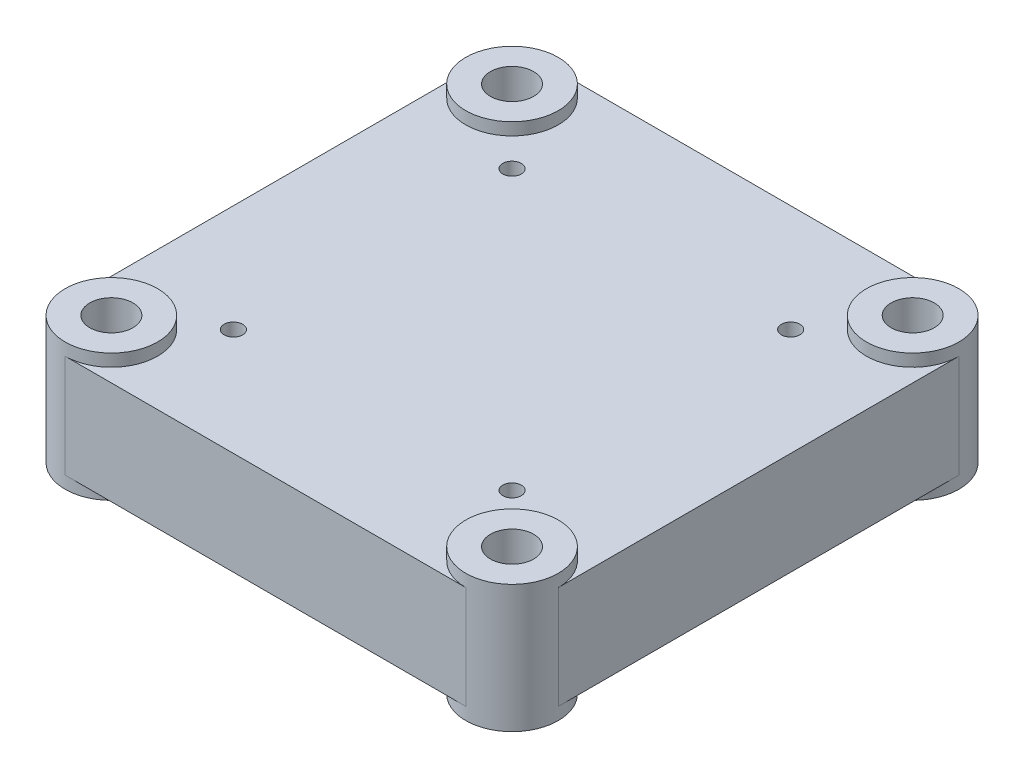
ISO-10303-21;
HEADER;
FILE_DESCRIPTION(('STEP AP214'),'2;1');
FILE_NAME('part.step','',(''),(''),'','','');
FILE_SCHEMA(('AUTOMOTIVE_DESIGN { 1 0 10303 214 1 1 1 1 }'));
ENDSEC;
DATA;
#1=APPLICATION_CONTEXT('core data for automotive mechanical design processes');
#2=APPLICATION_PROTOCOL_DEFINITION('international standard','automotive_design',2000,#1);
#3=PRODUCT_CONTEXT('',#1,'mechanical');
#4=PRODUCT('Part','Part','',(#3));
#5=PRODUCT_RELATED_PRODUCT_CATEGORY('part','',(#4));
#6=PRODUCT_DEFINITION_FORMATION('','',#4);
#7=PRODUCT_DEFINITION_CONTEXT('part definition',#1,'design');
#8=PRODUCT_DEFINITION('design','',#6,#7);
#9=PRODUCT_DEFINITION_SHAPE('','',#8);
#10=(LENGTH_UNIT() NAMED_UNIT(*) SI_UNIT(.MILLI.,.METRE.));
#11=(NAMED_UNIT(*) PLANE_ANGLE_UNIT() SI_UNIT($,.RADIAN.));
#12=(NAMED_UNIT(*) SI_UNIT($,.STERADIAN.) SOLID_ANGLE_UNIT());
#13=UNCERTAINTY_MEASURE_WITH_UNIT(LENGTH_MEASURE(1.E-05),#10,'distance_accuracy_value','');
#14=(GEOMETRIC_REPRESENTATION_CONTEXT(3) GLOBAL_UNCERTAINTY_ASSIGNED_CONTEXT((#13)) GLOBAL_UNIT_ASSIGNED_CONTEXT((#10,
#11,#12)) REPRESENTATION_CONTEXT('',''));
#15=CARTESIAN_POINT('',(0.,0.,0.));
#16=DIRECTION('',(0.,0.,1.));
#17=DIRECTION('',(1.,0.,0.));
#18=AXIS2_PLACEMENT_3D('',#15,#16,#17);
#19=CARTESIAN_POINT('',(-32.5,0.,32.5));
#20=DIRECTION('',(0.,-1.,0.));
#21=DIRECTION('',(0.,0.,-1.));
#22=AXIS2_PLACEMENT_3D('',#19,#20,#21);
#23=PLANE('',#22);
#24=CARTESIAN_POINT('',(0.,0.,0.));
#25=DIRECTION('',(0.,-1.,0.));
#26=DIRECTION('',(0.,0.,-1.));
#27=AXIS2_PLACEMENT_3D('',#24,#25,#26);
#28=CIRCLE('',#27,17.4);
#29=CARTESIAN_POINT('',(0.,0.,-17.4));
#30=VERTEX_POINT('',#29);
#31=EDGE_CURVE('E226',#30,#30,#28,.T.);
#32=ORIENTED_EDGE('',*,*,#31,.F.);
#33=EDGE_LOOP('',(#32));
#34=FACE_BOUND('',#33,.T.);
#35=CARTESIAN_POINT('',(-22.6005050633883,0.,-22.6005050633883));
#36=DIRECTION('',(0.,1.,0.));
#37=DIRECTION('',(0.,0.,1.));
#38=AXIS2_PLACEMENT_3D('',#35,#36,#37);
#39=CIRCLE('',#38,1.5);
#40=CARTESIAN_POINT('',(-22.6005050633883,0.,-21.1005050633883));
#41=VERTEX_POINT('',#40);
#42=EDGE_CURVE('E186',#41,#41,#39,.T.);
#43=ORIENTED_EDGE('',*,*,#42,.T.);
#44=EDGE_LOOP('',(#43));
#45=FACE_BOUND('',#44,.T.);
#46=CARTESIAN_POINT('',(22.6005050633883,0.,22.6005050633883));
#47=DIRECTION('',(0.,1.,0.));
#48=DIRECTION('',(0.,0.,1.));
#49=AXIS2_PLACEMENT_3D('',#46,#47,#48);
#50=CIRCLE('',#49,1.5);
#51=CARTESIAN_POINT('',(22.6005050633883,0.,24.1005050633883));
#52=VERTEX_POINT('',#51);
#53=EDGE_CURVE('E166',#52,#52,#50,.T.);
#54=ORIENTED_EDGE('',*,*,#53,.T.);
#55=EDGE_LOOP('',(#54));
#56=FACE_BOUND('',#55,.T.);
#57=CARTESIAN_POINT('',(-22.6005050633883,0.,22.6005050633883));
#58=DIRECTION('',(0.,1.,0.));
#59=DIRECTION('',(0.,0.,-1.));
#60=AXIS2_PLACEMENT_3D('',#57,#58,#59);
#61=CIRCLE('',#60,1.5);
#62=CARTESIAN_POINT('',(-22.6005050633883,0.,21.1005050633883));
#63=VERTEX_POINT('',#62);
#64=EDGE_CURVE('E180',#63,#63,#61,.T.);
#65=ORIENTED_EDGE('',*,*,#64,.T.);
#66=EDGE_LOOP('',(#65));
#67=FACE_BOUND('',#66,.T.);
#68=CARTESIAN_POINT('',(22.6005050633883,0.,-22.6005050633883));
#69=DIRECTION('',(0.,1.,0.));
#70=DIRECTION('',(0.,0.,-1.));
#71=AXIS2_PLACEMENT_3D('',#68,#69,#70);
#72=CIRCLE('',#71,1.5);
#73=CARTESIAN_POINT('',(22.6005050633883,0.,-24.1005050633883));
#74=VERTEX_POINT('',#73);
#75=EDGE_CURVE('E192',#74,#74,#72,.T.);
#76=ORIENTED_EDGE('',*,*,#75,.T.);
#77=EDGE_LOOP('',(#76));
#78=FACE_BOUND('',#77,.T.);
#79=DIRECTION('',(0.,0.,1.));
#80=VECTOR('',#79,1.);
#81=CARTESIAN_POINT('',(-40.,0.,32.5));
#82=LINE('',#81,#80);
#83=CARTESIAN_POINT('',(-40.,0.,-32.4999999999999));
#84=VERTEX_POINT('',#83);
#85=CARTESIAN_POINT('',(-40.,0.,32.5));
#86=VERTEX_POINT('',#85);
#87=EDGE_CURVE('E113',#84,#86,#82,.T.);
#88=ORIENTED_EDGE('',*,*,#87,.F.);
#89=CARTESIAN_POINT('',(-32.5,0.,-32.5));
#90=DIRECTION('',(0.,-1.,0.));
#91=DIRECTION('',(0.,0.,-1.));
#92=AXIS2_PLACEMENT_3D('',#89,#90,#91);
#93=CIRCLE('',#92,7.5);
#94=CARTESIAN_POINT('',(-32.5,0.,-40.));
#95=VERTEX_POINT('',#94);
#96=EDGE_CURVE('E79',#95,#84,#93,.T.);
#97=ORIENTED_EDGE('',*,*,#96,.F.);
#98=DIRECTION('',(-1.,0.,0.));
#99=VECTOR('',#98,1.);
#100=CARTESIAN_POINT('',(-32.5,0.,-40.));
#101=LINE('',#100,#99);
#102=CARTESIAN_POINT('',(32.4999999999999,0.,-40.));
#103=VERTEX_POINT('',#102);
#104=EDGE_CURVE('E111',#103,#95,#101,.T.);
#105=ORIENTED_EDGE('',*,*,#104,.F.);
#106=CARTESIAN_POINT('',(32.5,0.,-32.5));
#107=DIRECTION('',(0.,-1.,0.));
#108=DIRECTION('',(0.,0.,-1.));
#109=AXIS2_PLACEMENT_3D('',#106,#107,#108);
#110=CIRCLE('',#109,7.5);
#111=CARTESIAN_POINT('',(40.,0.,-32.4999999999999));
#112=VERTEX_POINT('',#111);
#113=EDGE_CURVE('E71',#112,#103,#110,.T.);
#114=ORIENTED_EDGE('',*,*,#113,.F.);
#115=DIRECTION('',(0.,0.,-1.));
#116=VECTOR('',#115,1.);
#117=CARTESIAN_POINT('',(40.,0.,32.5));
#118=LINE('',#117,#116);
#119=CARTESIAN_POINT('',(40.,0.,32.5));
#120=VERTEX_POINT('',#119);
#121=EDGE_CURVE('E124',#120,#112,#118,.T.);
#122=ORIENTED_EDGE('',*,*,#121,.F.);
#123=CARTESIAN_POINT('',(32.5,0.,32.5));
#124=DIRECTION('',(0.,-1.,0.));
#125=DIRECTION('',(0.,0.,-1.));
#126=AXIS2_PLACEMENT_3D('',#123,#124,#125);
#127=CIRCLE('',#126,7.5);
#128=CARTESIAN_POINT('',(32.4999999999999,0.,40.));
#129=VERTEX_POINT('',#128);
#130=EDGE_CURVE('E160',#129,#120,#127,.T.);
#131=ORIENTED_EDGE('',*,*,#130,.F.);
#132=DIRECTION('',(1.,0.,0.));
#133=VECTOR('',#132,1.);
#134=CARTESIAN_POINT('',(-32.5,0.,40.));
#135=LINE('',#134,#133);
#136=CARTESIAN_POINT('',(-32.5,0.,40.));
#137=VERTEX_POINT('',#136);
#138=EDGE_CURVE('E149',#137,#129,#135,.T.);
#139=ORIENTED_EDGE('',*,*,#138,.F.);
#140=CARTESIAN_POINT('',(-32.5,0.,32.5));
#141=DIRECTION('',(0.,-1.,0.));
#142=DIRECTION('',(0.,0.,-1.));
#143=AXIS2_PLACEMENT_3D('',#140,#141,#142);
#144=CIRCLE('',#143,7.5);
#145=EDGE_CURVE('E155',#86,#137,#144,.T.);
#146=ORIENTED_EDGE('',*,*,#145,.F.);
#147=EDGE_LOOP('',(#88,#97,#105,#114,#122,#131,#139,#146));
#148=FACE_BOUND('',#147,.T.);
#149=ADVANCED_FACE('F34',(#34,#45,#56,#67,#78,#148),#23,.T.);
#150=CARTESIAN_POINT('',(-32.5,16.7,32.5));
#151=DIRECTION('',(0.,-1.,0.));
#152=DIRECTION('',(0.,0.,-1.));
#153=AXIS2_PLACEMENT_3D('',#150,#151,#152);
#154=PLANE('',#153);
#155=DIRECTION('',(-1.,0.,0.));
#156=VECTOR('',#155,1.);
#157=CARTESIAN_POINT('',(-32.5,16.7,-40.));
#158=LINE('',#157,#156);
#159=CARTESIAN_POINT('',(32.4999999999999,16.7,-40.));
#160=VERTEX_POINT('',#159);
#161=CARTESIAN_POINT('',(-32.5,16.7,-40.));
#162=VERTEX_POINT('',#161);
#163=EDGE_CURVE('E171',#160,#162,#158,.T.);
#164=ORIENTED_EDGE('',*,*,#163,.T.);
#165=CARTESIAN_POINT('',(-32.5,16.7,-32.5));
#166=DIRECTION('',(0.,-1.,0.));
#167=DIRECTION('',(0.,0.,-1.));
#168=AXIS2_PLACEMENT_3D('',#165,#166,#167);
#169=CIRCLE('',#168,7.5);
#170=CARTESIAN_POINT('',(-40.,16.7,-32.5));
#171=VERTEX_POINT('',#170);
#172=EDGE_CURVE('E128',#162,#171,#169,.T.);
#173=ORIENTED_EDGE('',*,*,#172,.T.);
#174=DIRECTION('',(0.,0.,1.));
#175=VECTOR('',#174,1.);
#176=CARTESIAN_POINT('',(-40.,16.7,32.5));
#177=LINE('',#176,#175);
#178=CARTESIAN_POINT('',(-40.,16.7,32.5));
#179=VERTEX_POINT('',#178);
#180=EDGE_CURVE('E52',#171,#179,#177,.T.);
#181=ORIENTED_EDGE('',*,*,#180,.T.);
#182=CARTESIAN_POINT('',(-32.5,16.7,32.5));
#183=DIRECTION('',(0.,-1.,0.));
#184=DIRECTION('',(0.,0.,-1.));
#185=AXIS2_PLACEMENT_3D('',#182,#183,#184);
#186=CIRCLE('',#185,7.5);
#187=CARTESIAN_POINT('',(-32.5,16.7,40.));
#188=VERTEX_POINT('',#187);
#189=EDGE_CURVE('E154',#179,#188,#186,.T.);
#190=ORIENTED_EDGE('',*,*,#189,.T.);
#191=DIRECTION('',(1.,0.,0.));
#192=VECTOR('',#191,1.);
#193=CARTESIAN_POINT('',(-32.5,16.7,40.));
#194=LINE('',#193,#192);
#195=CARTESIAN_POINT('',(32.4999999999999,16.7,40.));
#196=VERTEX_POINT('',#195);
#197=EDGE_CURVE('E85',#188,#196,#194,.T.);
#198=ORIENTED_EDGE('',*,*,#197,.T.);
#199=CARTESIAN_POINT('',(32.5,16.7,32.5));
#200=DIRECTION('',(0.,-1.,0.));
#201=DIRECTION('',(0.,0.,-1.));
#202=AXIS2_PLACEMENT_3D('',#199,#200,#201);
#203=CIRCLE('',#202,7.5);
#204=CARTESIAN_POINT('',(40.,16.7,32.5));
#205=VERTEX_POINT('',#204);
#206=EDGE_CURVE('E204',#196,#205,#203,.T.);
#207=ORIENTED_EDGE('',*,*,#206,.T.);
#208=DIRECTION('',(0.,0.,-1.));
#209=VECTOR('',#208,1.);
#210=CARTESIAN_POINT('',(40.,16.7,32.5));
#211=LINE('',#210,#209);
#212=CARTESIAN_POINT('',(40.,16.7,-32.5));
#213=VERTEX_POINT('',#212);
#214=EDGE_CURVE('E172',#205,#213,#211,.T.);
#215=ORIENTED_EDGE('',*,*,#214,.T.);
#216=CARTESIAN_POINT('',(32.5,16.7,-32.5));
#217=DIRECTION('',(0.,-1.,0.));
#218=DIRECTION('',(0.,0.,-1.));
#219=AXIS2_PLACEMENT_3D('',#216,#217,#218);
#220=CIRCLE('',#219,7.5);
#221=EDGE_CURVE('E11',#213,#160,#220,.T.);
#222=ORIENTED_EDGE('',*,*,#221,.T.);
#223=EDGE_LOOP('',(#164,#173,#181,#190,#198,#207,#215,#222));
#224=FACE_BOUND('',#223,.T.);
#225=CARTESIAN_POINT('',(22.6005050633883,16.7,22.6005050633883));
#226=DIRECTION('',(0.,1.,0.));
#227=DIRECTION('',(0.,0.,1.));
#228=AXIS2_PLACEMENT_3D('',#225,#226,#227);
#229=CIRCLE('',#228,1.5);
#230=CARTESIAN_POINT('',(22.6005050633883,16.7,24.1005050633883));
#231=VERTEX_POINT('',#230);
#232=EDGE_CURVE('E161',#231,#231,#229,.T.);
#233=ORIENTED_EDGE('',*,*,#232,.F.);
#234=EDGE_LOOP('',(#233));
#235=FACE_BOUND('',#234,.T.);
#236=CARTESIAN_POINT('',(-22.6005050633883,16.7,22.6005050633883));
#237=DIRECTION('',(0.,1.,0.));
#238=DIRECTION('',(0.,0.,-1.));
#239=AXIS2_PLACEMENT_3D('',#236,#237,#238);
#240=CIRCLE('',#239,1.5);
#241=CARTESIAN_POINT('',(-22.6005050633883,16.7,21.1005050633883));
#242=VERTEX_POINT('',#241);
#243=EDGE_CURVE('E178',#242,#242,#240,.T.);
#244=ORIENTED_EDGE('',*,*,#243,.F.);
#245=EDGE_LOOP('',(#244));
#246=FACE_BOUND('',#245,.T.);
#247=CARTESIAN_POINT('',(-22.6005050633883,16.7,-22.6005050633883));
#248=DIRECTION('',(0.,1.,0.));
#249=DIRECTION('',(0.,0.,1.));
#250=AXIS2_PLACEMENT_3D('',#247,#248,#249);
#251=CIRCLE('',#250,1.5);
#252=CARTESIAN_POINT('',(-22.6005050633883,16.7,-21.1005050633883));
#253=VERTEX_POINT('',#252);
#254=EDGE_CURVE('E183',#253,#253,#251,.T.);
#255=ORIENTED_EDGE('',*,*,#254,.F.);
#256=EDGE_LOOP('',(#255));
#257=FACE_BOUND('',#256,.T.);
#258=CARTESIAN_POINT('',(22.6005050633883,16.7,-22.6005050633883));
#259=DIRECTION('',(0.,1.,0.));
#260=DIRECTION('',(0.,0.,-1.));
#261=AXIS2_PLACEMENT_3D('',#258,#259,#260);
#262=CIRCLE('',#261,1.5);
#263=CARTESIAN_POINT('',(22.6005050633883,16.7,-24.1005050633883));
#264=VERTEX_POINT('',#263);
#265=EDGE_CURVE('E189',#264,#264,#262,.T.);
#266=ORIENTED_EDGE('',*,*,#265,.F.);
#267=EDGE_LOOP('',(#266));
#268=FACE_BOUND('',#267,.T.);
#269=ADVANCED_FACE('F268',(#224,#235,#246,#257,#268),#154,.F.);
#270=CARTESIAN_POINT('',(-32.5,16.7,32.5));
#271=DIRECTION('',(0.,-1.,0.));
#272=DIRECTION('',(0.,0.,-1.));
#273=AXIS2_PLACEMENT_3D('',#270,#271,#272);
#274=CYLINDRICAL_SURFACE('',#273,7.5);
#275=DIRECTION('',(0.,-1.,0.));
#276=VECTOR('',#275,1.);
#277=CARTESIAN_POINT('',(-40.,16.7,32.5));
#278=LINE('',#277,#276);
#279=EDGE_CURVE('E133',#179,#86,#278,.T.);
#280=ORIENTED_EDGE('',*,*,#279,.T.);
#281=ORIENTED_EDGE('',*,*,#145,.T.);
#282=DIRECTION('',(0.,-1.,0.));
#283=VECTOR('',#282,1.);
#284=CARTESIAN_POINT('',(-32.5,16.7,40.));
#285=LINE('',#284,#283);
#286=EDGE_CURVE('E38',#188,#137,#285,.T.);
#287=ORIENTED_EDGE('',*,*,#286,.F.);
#288=ORIENTED_EDGE('',*,*,#189,.F.);
#289=EDGE_LOOP('',(#280,#281,#287,#288));
#290=FACE_BOUND('',#289,.T.);
#291=CARTESIAN_POINT('',(-32.5,18.7,32.5));
#292=DIRECTION('',(0.,-1.,0.));
#293=DIRECTION('',(0.,0.,-1.));
#294=AXIS2_PLACEMENT_3D('',#291,#292,#293);
#295=CIRCLE('',#294,7.5);
#296=CARTESIAN_POINT('',(-32.5,18.7,25.));
#297=VERTEX_POINT('',#296);
#298=EDGE_CURVE('E211',#297,#297,#295,.T.);
#299=ORIENTED_EDGE('',*,*,#298,.T.);
#300=EDGE_LOOP('',(#299));
#301=FACE_BOUND('',#300,.T.);
#302=CARTESIAN_POINT('',(-32.5,-2.,32.5));
#303=DIRECTION('',(0.,-1.,0.));
#304=DIRECTION('',(0.,0.,-1.));
#305=AXIS2_PLACEMENT_3D('',#302,#303,#304);
#306=CIRCLE('',#305,7.5);
#307=CARTESIAN_POINT('',(-32.5,-2.,25.));
#308=VERTEX_POINT('',#307);
#309=EDGE_CURVE('E156',#308,#308,#306,.T.);
#310=ORIENTED_EDGE('',*,*,#309,.F.);
#311=EDGE_LOOP('',(#310));
#312=FACE_BOUND('',#311,.T.);
#313=ADVANCED_FACE('F36',(#290,#301,#312),#274,.T.);
#314=CARTESIAN_POINT('',(-32.5,16.7,40.));
#315=DIRECTION('',(0.,0.,-1.));
#316=DIRECTION('',(-1.,0.,0.));
#317=AXIS2_PLACEMENT_3D('',#314,#315,#316);
#318=PLANE('',#317);
#319=ORIENTED_EDGE('',*,*,#138,.T.);
#320=DIRECTION('',(0.,-1.,0.));
#321=VECTOR('',#320,1.);
#322=CARTESIAN_POINT('',(32.4999999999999,16.7,40.));
#323=LINE('',#322,#321);
#324=EDGE_CURVE('E140',#196,#129,#323,.T.);
#325=ORIENTED_EDGE('',*,*,#324,.F.);
#326=ORIENTED_EDGE('',*,*,#197,.F.);
#327=ORIENTED_EDGE('',*,*,#286,.T.);
#328=EDGE_LOOP('',(#319,#325,#326,#327));
#329=FACE_BOUND('',#328,.T.);
#330=ADVANCED_FACE('F147',(#329),#318,.F.);
#331=CARTESIAN_POINT('',(32.5,16.7,32.5));
#332=DIRECTION('',(0.,-1.,0.));
#333=DIRECTION('',(0.,0.,-1.));
#334=AXIS2_PLACEMENT_3D('',#331,#332,#333);
#335=CYLINDRICAL_SURFACE('',#334,7.5);
#336=ORIENTED_EDGE('',*,*,#324,.T.);
#337=ORIENTED_EDGE('',*,*,#130,.T.);
#338=DIRECTION('',(0.,-1.,0.));
#339=VECTOR('',#338,1.);
#340=CARTESIAN_POINT('',(40.,16.7,32.5));
#341=LINE('',#340,#339);
#342=EDGE_CURVE('E138',#205,#120,#341,.T.);
#343=ORIENTED_EDGE('',*,*,#342,.F.);
#344=ORIENTED_EDGE('',*,*,#206,.F.);
#345=EDGE_LOOP('',(#336,#337,#343,#344));
#346=FACE_BOUND('',#345,.T.);
#347=CARTESIAN_POINT('',(32.5,18.7,32.5));
#348=DIRECTION('',(0.,-1.,0.));
#349=DIRECTION('',(0.,0.,-1.));
#350=AXIS2_PLACEMENT_3D('',#347,#348,#349);
#351=CIRCLE('',#350,7.5);
#352=CARTESIAN_POINT('',(32.5,18.7,25.));
#353=VERTEX_POINT('',#352);
#354=EDGE_CURVE('E203',#353,#353,#351,.T.);
#355=ORIENTED_EDGE('',*,*,#354,.T.);
#356=EDGE_LOOP('',(#355));
#357=FACE_BOUND('',#356,.T.);
#358=CARTESIAN_POINT('',(32.5,-2.,32.5));
#359=DIRECTION('',(0.,-1.,0.));
#360=DIRECTION('',(0.,0.,-1.));
#361=AXIS2_PLACEMENT_3D('',#358,#359,#360);
#362=CIRCLE('',#361,7.5);
#363=CARTESIAN_POINT('',(32.5,-2.,25.));
#364=VERTEX_POINT('',#363);
#365=EDGE_CURVE('E238',#364,#364,#362,.T.);
#366=ORIENTED_EDGE('',*,*,#365,.F.);
#367=EDGE_LOOP('',(#366));
#368=FACE_BOUND('',#367,.T.);
#369=ADVANCED_FACE('F294',(#346,#357,#368),#335,.T.);
#370=CARTESIAN_POINT('',(40.,16.7,32.5));
#371=DIRECTION('',(-1.,0.,0.));
#372=DIRECTION('',(0.,0.,1.));
#373=AXIS2_PLACEMENT_3D('',#370,#371,#372);
#374=PLANE('',#373);
#375=ORIENTED_EDGE('',*,*,#121,.T.);
#376=DIRECTION('',(0.,-1.,0.));
#377=VECTOR('',#376,1.);
#378=CARTESIAN_POINT('',(40.,16.7,-32.4999999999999));
#379=LINE('',#378,#377);
#380=EDGE_CURVE('E131',#213,#112,#379,.T.);
#381=ORIENTED_EDGE('',*,*,#380,.F.);
#382=ORIENTED_EDGE('',*,*,#214,.F.);
#383=ORIENTED_EDGE('',*,*,#342,.T.);
#384=EDGE_LOOP('',(#375,#381,#382,#383));
#385=FACE_BOUND('',#384,.T.);
#386=ADVANCED_FACE('F291',(#385),#374,.F.);
#387=CARTESIAN_POINT('',(32.5,16.7,-32.5));
#388=DIRECTION('',(0.,-1.,0.));
#389=DIRECTION('',(0.,0.,-1.));
#390=AXIS2_PLACEMENT_3D('',#387,#388,#389);
#391=CYLINDRICAL_SURFACE('',#390,7.5);
#392=ORIENTED_EDGE('',*,*,#380,.T.);
#393=ORIENTED_EDGE('',*,*,#113,.T.);
#394=DIRECTION('',(0.,-1.,0.));
#395=VECTOR('',#394,1.);
#396=CARTESIAN_POINT('',(32.4999999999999,16.7,-40.));
#397=LINE('',#396,#395);
#398=EDGE_CURVE('E123',#160,#103,#397,.T.);
#399=ORIENTED_EDGE('',*,*,#398,.F.);
#400=ORIENTED_EDGE('',*,*,#221,.F.);
#401=EDGE_LOOP('',(#392,#393,#399,#400));
#402=FACE_BOUND('',#401,.T.);
#403=CARTESIAN_POINT('',(32.5,18.7,-32.5));
#404=DIRECTION('',(0.,-1.,0.));
#405=DIRECTION('',(0.,0.,-1.));
#406=AXIS2_PLACEMENT_3D('',#403,#404,#405);
#407=CIRCLE('',#406,7.5);
#408=CARTESIAN_POINT('',(32.5,18.7,-40.));
#409=VERTEX_POINT('',#408);
#410=EDGE_CURVE('E195',#409,#409,#407,.T.);
#411=ORIENTED_EDGE('',*,*,#410,.T.);
#412=EDGE_LOOP('',(#411));
#413=FACE_BOUND('',#412,.T.);
#414=CARTESIAN_POINT('',(32.5,-2.,-32.5));
#415=DIRECTION('',(0.,-1.,0.));
#416=DIRECTION('',(0.,0.,-1.));
#417=AXIS2_PLACEMENT_3D('',#414,#415,#416);
#418=CIRCLE('',#417,7.5);
#419=CARTESIAN_POINT('',(32.5,-2.,-40.));
#420=VERTEX_POINT('',#419);
#421=EDGE_CURVE('E229',#420,#420,#418,.T.);
#422=ORIENTED_EDGE('',*,*,#421,.F.);
#423=EDGE_LOOP('',(#422));
#424=FACE_BOUND('',#423,.T.);
#425=ADVANCED_FACE('F288',(#402,#413,#424),#391,.T.);
#426=CARTESIAN_POINT('',(-32.5,16.7,-40.));
#427=DIRECTION('',(0.,0.,1.));
#428=DIRECTION('',(1.,0.,0.));
#429=AXIS2_PLACEMENT_3D('',#426,#427,#428);
#430=PLANE('',#429);
#431=ORIENTED_EDGE('',*,*,#104,.T.);
#432=DIRECTION('',(0.,-1.,0.));
#433=VECTOR('',#432,1.);
#434=CARTESIAN_POINT('',(-32.5,16.7,-40.));
#435=LINE('',#434,#433);
#436=EDGE_CURVE('E121',#162,#95,#435,.T.);
#437=ORIENTED_EDGE('',*,*,#436,.F.);
#438=ORIENTED_EDGE('',*,*,#163,.F.);
#439=ORIENTED_EDGE('',*,*,#398,.T.);
#440=EDGE_LOOP('',(#431,#437,#438,#439));
#441=FACE_BOUND('',#440,.T.);
#442=ADVANCED_FACE('F119',(#441),#430,.F.);
#443=CARTESIAN_POINT('',(-32.5,16.7,-32.5));
#444=DIRECTION('',(0.,-1.,0.));
#445=DIRECTION('',(0.,0.,-1.));
#446=AXIS2_PLACEMENT_3D('',#443,#444,#445);
#447=CYLINDRICAL_SURFACE('',#446,7.5);
#448=ORIENTED_EDGE('',*,*,#436,.T.);
#449=ORIENTED_EDGE('',*,*,#96,.T.);
#450=DIRECTION('',(0.,-1.,0.));
#451=VECTOR('',#450,1.);
#452=CARTESIAN_POINT('',(-40.,16.7,-32.4999999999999));
#453=LINE('',#452,#451);
#454=EDGE_CURVE('E129',#171,#84,#453,.T.);
#455=ORIENTED_EDGE('',*,*,#454,.F.);
#456=ORIENTED_EDGE('',*,*,#172,.F.);
#457=EDGE_LOOP('',(#448,#449,#455,#456));
#458=FACE_BOUND('',#457,.T.);
#459=CARTESIAN_POINT('',(-32.5,18.7,-32.5));
#460=DIRECTION('',(0.,-1.,0.));
#461=DIRECTION('',(0.,0.,-1.));
#462=AXIS2_PLACEMENT_3D('',#459,#460,#461);
#463=CIRCLE('',#462,7.5);
#464=CARTESIAN_POINT('',(-32.5,18.7,-40.));
#465=VERTEX_POINT('',#464);
#466=EDGE_CURVE('E218',#465,#465,#463,.T.);
#467=ORIENTED_EDGE('',*,*,#466,.T.);
#468=EDGE_LOOP('',(#467));
#469=FACE_BOUND('',#468,.T.);
#470=CARTESIAN_POINT('',(-32.5,-2.,-32.5));
#471=DIRECTION('',(0.,-1.,0.));
#472=DIRECTION('',(0.,0.,-1.));
#473=AXIS2_PLACEMENT_3D('',#470,#471,#472);
#474=CIRCLE('',#473,7.5);
#475=CARTESIAN_POINT('',(-32.5,-2.,-40.));
#476=VERTEX_POINT('',#475);
#477=EDGE_CURVE('E114',#476,#476,#474,.T.);
#478=ORIENTED_EDGE('',*,*,#477,.F.);
#479=EDGE_LOOP('',(#478));
#480=FACE_BOUND('',#479,.T.);
#481=ADVANCED_FACE('F126',(#458,#469,#480),#447,.T.);
#482=CARTESIAN_POINT('',(-40.,16.7,32.5));
#483=DIRECTION('',(1.,0.,0.));
#484=DIRECTION('',(0.,0.,-1.));
#485=AXIS2_PLACEMENT_3D('',#482,#483,#484);
#486=PLANE('',#485);
#487=ORIENTED_EDGE('',*,*,#87,.T.);
#488=ORIENTED_EDGE('',*,*,#279,.F.);
#489=ORIENTED_EDGE('',*,*,#180,.F.);
#490=ORIENTED_EDGE('',*,*,#454,.T.);
#491=EDGE_LOOP('',(#487,#488,#489,#490));
#492=FACE_BOUND('',#491,.T.);
#493=ADVANCED_FACE('F279',(#492),#486,.F.);
#494=CARTESIAN_POINT('',(32.5,16.7,-32.5));
#495=DIRECTION('',(0.,-1.,0.));
#496=DIRECTION('',(0.,0.,-1.));
#497=AXIS2_PLACEMENT_3D('',#494,#495,#496);
#498=CYLINDRICAL_SURFACE('',#497,3.5);
#499=CARTESIAN_POINT('',(32.5,18.7,-32.5));
#500=DIRECTION('',(0.,-1.,0.));
#501=DIRECTION('',(0.,0.,-1.));
#502=AXIS2_PLACEMENT_3D('',#499,#500,#501);
#503=CIRCLE('',#502,3.50000000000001);
#504=CARTESIAN_POINT('',(32.5,18.7,-36.));
#505=VERTEX_POINT('',#504);
#506=EDGE_CURVE('E200',#505,#505,#503,.T.);
#507=ORIENTED_EDGE('',*,*,#506,.F.);
#508=EDGE_LOOP('',(#507));
#509=FACE_BOUND('',#508,.T.);
#510=CARTESIAN_POINT('',(32.5,-2.,-32.5));
#511=DIRECTION('',(0.,-1.,0.));
#512=DIRECTION('',(0.,0.,-1.));
#513=AXIS2_PLACEMENT_3D('',#510,#511,#512);
#514=CIRCLE('',#513,3.50000000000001);
#515=CARTESIAN_POINT('',(32.5,-2.,-36.));
#516=VERTEX_POINT('',#515);
#517=EDGE_CURVE('E233',#516,#516,#514,.T.);
#518=ORIENTED_EDGE('',*,*,#517,.T.);
#519=EDGE_LOOP('',(#518));
#520=FACE_BOUND('',#519,.T.);
#521=ADVANCED_FACE('F282',(#509,#520),#498,.F.);
#522=CARTESIAN_POINT('',(-32.5,16.7,32.5));
#523=DIRECTION('',(0.,-1.,0.));
#524=DIRECTION('',(0.,0.,-1.));
#525=AXIS2_PLACEMENT_3D('',#522,#523,#524);
#526=CYLINDRICAL_SURFACE('',#525,3.49999999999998);
#527=CARTESIAN_POINT('',(-32.5,18.7,32.5));
#528=DIRECTION('',(0.,-1.,0.));
#529=DIRECTION('',(0.,0.,-1.));
#530=AXIS2_PLACEMENT_3D('',#527,#528,#529);
#531=CIRCLE('',#530,3.50000000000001);
#532=CARTESIAN_POINT('',(-32.5,18.7,29.));
#533=VERTEX_POINT('',#532);
#534=EDGE_CURVE('E213',#533,#533,#531,.T.);
#535=ORIENTED_EDGE('',*,*,#534,.F.);
#536=EDGE_LOOP('',(#535));
#537=FACE_BOUND('',#536,.T.);
#538=CARTESIAN_POINT('',(-32.5,-2.,32.5));
#539=DIRECTION('',(0.,-1.,0.));
#540=DIRECTION('',(0.,0.,-1.));
#541=AXIS2_PLACEMENT_3D('',#538,#539,#540);
#542=CIRCLE('',#541,3.50000000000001);
#543=CARTESIAN_POINT('',(-32.5,-2.,29.));
#544=VERTEX_POINT('',#543);
#545=EDGE_CURVE('E157',#544,#544,#542,.T.);
#546=ORIENTED_EDGE('',*,*,#545,.T.);
#547=EDGE_LOOP('',(#546));
#548=FACE_BOUND('',#547,.T.);
#549=ADVANCED_FACE('F427',(#537,#548),#526,.F.);
#550=CARTESIAN_POINT('',(-32.5,16.7,-32.5));
#551=DIRECTION('',(0.,-1.,0.));
#552=DIRECTION('',(0.,0.,-1.));
#553=AXIS2_PLACEMENT_3D('',#550,#551,#552);
#554=CYLINDRICAL_SURFACE('',#553,3.5);
#555=CARTESIAN_POINT('',(-32.5,18.7,-32.5));
#556=DIRECTION('',(0.,-1.,0.));
#557=DIRECTION('',(0.,0.,-1.));
#558=AXIS2_PLACEMENT_3D('',#555,#556,#557);
#559=CIRCLE('',#558,3.50000000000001);
#560=CARTESIAN_POINT('',(-32.5,18.7,-36.));
#561=VERTEX_POINT('',#560);
#562=EDGE_CURVE('E220',#561,#561,#559,.T.);
#563=ORIENTED_EDGE('',*,*,#562,.F.);
#564=EDGE_LOOP('',(#563));
#565=FACE_BOUND('',#564,.T.);
#566=CARTESIAN_POINT('',(-32.5,-2.,-32.5));
#567=DIRECTION('',(0.,-1.,0.));
#568=DIRECTION('',(0.,0.,-1.));
#569=AXIS2_PLACEMENT_3D('',#566,#567,#568);
#570=CIRCLE('',#569,3.50000000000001);
#571=CARTESIAN_POINT('',(-32.5,-2.,-36.));
#572=VERTEX_POINT('',#571);
#573=EDGE_CURVE('E115',#572,#572,#570,.T.);
#574=ORIENTED_EDGE('',*,*,#573,.T.);
#575=EDGE_LOOP('',(#574));
#576=FACE_BOUND('',#575,.T.);
#577=ADVANCED_FACE('F254',(#565,#576),#554,.F.);
#578=CARTESIAN_POINT('',(32.5,16.7,32.5));
#579=DIRECTION('',(0.,-1.,0.));
#580=DIRECTION('',(0.,0.,-1.));
#581=AXIS2_PLACEMENT_3D('',#578,#579,#580);
#582=CYLINDRICAL_SURFACE('',#581,3.50000000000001);
#583=CARTESIAN_POINT('',(32.5,18.7,32.5));
#584=DIRECTION('',(0.,-1.,0.));
#585=DIRECTION('',(0.,0.,-1.));
#586=AXIS2_PLACEMENT_3D('',#583,#584,#585);
#587=CIRCLE('',#586,3.50000000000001);
#588=CARTESIAN_POINT('',(32.5,18.7,29.));
#589=VERTEX_POINT('',#588);
#590=EDGE_CURVE('E206',#589,#589,#587,.T.);
#591=ORIENTED_EDGE('',*,*,#590,.F.);
#592=EDGE_LOOP('',(#591));
#593=FACE_BOUND('',#592,.T.);
#594=CARTESIAN_POINT('',(32.5,-2.,32.5));
#595=DIRECTION('',(0.,-1.,0.));
#596=DIRECTION('',(0.,0.,-1.));
#597=AXIS2_PLACEMENT_3D('',#594,#595,#596);
#598=CIRCLE('',#597,3.50000000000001);
#599=CARTESIAN_POINT('',(32.5,-2.,29.));
#600=VERTEX_POINT('',#599);
#601=EDGE_CURVE('E240',#600,#600,#598,.T.);
#602=ORIENTED_EDGE('',*,*,#601,.T.);
#603=EDGE_LOOP('',(#602));
#604=FACE_BOUND('',#603,.T.);
#605=ADVANCED_FACE('F451',(#593,#604),#582,.F.);
#606=CARTESIAN_POINT('',(22.6005050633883,16.7,22.6005050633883));
#607=DIRECTION('',(0.,-1.,0.));
#608=DIRECTION('',(0.,0.,-1.));
#609=AXIS2_PLACEMENT_3D('',#606,#607,#608);
#610=CYLINDRICAL_SURFACE('',#609,1.5);
#611=ORIENTED_EDGE('',*,*,#232,.T.);
#612=EDGE_LOOP('',(#611));
#613=FACE_BOUND('',#612,.T.);
#614=ORIENTED_EDGE('',*,*,#53,.F.);
#615=EDGE_LOOP('',(#614));
#616=FACE_BOUND('',#615,.T.);
#617=ADVANCED_FACE('F463',(#613,#616),#610,.F.);
#618=CARTESIAN_POINT('',(-22.6005050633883,16.7,22.6005050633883));
#619=DIRECTION('',(0.,-1.,0.));
#620=DIRECTION('',(0.,0.,-1.));
#621=AXIS2_PLACEMENT_3D('',#618,#619,#620);
#622=CYLINDRICAL_SURFACE('',#621,1.5);
#623=ORIENTED_EDGE('',*,*,#243,.T.);
#624=EDGE_LOOP('',(#623));
#625=FACE_BOUND('',#624,.T.);
#626=ORIENTED_EDGE('',*,*,#64,.F.);
#627=EDGE_LOOP('',(#626));
#628=FACE_BOUND('',#627,.T.);
#629=ADVANCED_FACE('F503',(#625,#628),#622,.F.);
#630=CARTESIAN_POINT('',(-22.6005050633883,16.7,-22.6005050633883));
#631=DIRECTION('',(0.,-1.,0.));
#632=DIRECTION('',(0.,0.,-1.));
#633=AXIS2_PLACEMENT_3D('',#630,#631,#632);
#634=CYLINDRICAL_SURFACE('',#633,1.5);
#635=ORIENTED_EDGE('',*,*,#254,.T.);
#636=EDGE_LOOP('',(#635));
#637=FACE_BOUND('',#636,.T.);
#638=ORIENTED_EDGE('',*,*,#42,.F.);
#639=EDGE_LOOP('',(#638));
#640=FACE_BOUND('',#639,.T.);
#641=ADVANCED_FACE('F499',(#637,#640),#634,.F.);
#642=CARTESIAN_POINT('',(22.6005050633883,16.7,-22.6005050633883));
#643=DIRECTION('',(0.,-1.,0.));
#644=DIRECTION('',(0.,0.,-1.));
#645=AXIS2_PLACEMENT_3D('',#642,#643,#644);
#646=CYLINDRICAL_SURFACE('',#645,1.5);
#647=ORIENTED_EDGE('',*,*,#265,.T.);
#648=EDGE_LOOP('',(#647));
#649=FACE_BOUND('',#648,.T.);
#650=ORIENTED_EDGE('',*,*,#75,.F.);
#651=EDGE_LOOP('',(#650));
#652=FACE_BOUND('',#651,.T.);
#653=ADVANCED_FACE('F314',(#649,#652),#646,.F.);
#654=CARTESIAN_POINT('',(32.5,18.7,-32.5));
#655=DIRECTION('',(0.,-1.,0.));
#656=DIRECTION('',(0.,0.,-1.));
#657=AXIS2_PLACEMENT_3D('',#654,#655,#656);
#658=PLANE('',#657);
#659=ORIENTED_EDGE('',*,*,#506,.T.);
#660=EDGE_LOOP('',(#659));
#661=FACE_BOUND('',#660,.T.);
#662=ORIENTED_EDGE('',*,*,#410,.F.);
#663=EDGE_LOOP('',(#662));
#664=FACE_BOUND('',#663,.T.);
#665=ADVANCED_FACE('F319',(#661,#664),#658,.F.);
#666=CARTESIAN_POINT('',(32.5,18.7,32.5));
#667=DIRECTION('',(0.,-1.,0.));
#668=DIRECTION('',(0.,0.,-1.));
#669=AXIS2_PLACEMENT_3D('',#666,#667,#668);
#670=PLANE('',#669);
#671=ORIENTED_EDGE('',*,*,#590,.T.);
#672=EDGE_LOOP('',(#671));
#673=FACE_BOUND('',#672,.T.);
#674=ORIENTED_EDGE('',*,*,#354,.F.);
#675=EDGE_LOOP('',(#674));
#676=FACE_BOUND('',#675,.T.);
#677=ADVANCED_FACE('F324',(#673,#676),#670,.F.);
#678=CARTESIAN_POINT('',(-32.5,18.7,32.5));
#679=DIRECTION('',(0.,-1.,0.));
#680=DIRECTION('',(0.,0.,-1.));
#681=AXIS2_PLACEMENT_3D('',#678,#679,#680);
#682=PLANE('',#681);
#683=ORIENTED_EDGE('',*,*,#534,.T.);
#684=EDGE_LOOP('',(#683));
#685=FACE_BOUND('',#684,.T.);
#686=ORIENTED_EDGE('',*,*,#298,.F.);
#687=EDGE_LOOP('',(#686));
#688=FACE_BOUND('',#687,.T.);
#689=ADVANCED_FACE('F335',(#685,#688),#682,.F.);
#690=CARTESIAN_POINT('',(-32.5,18.7,-32.5));
#691=DIRECTION('',(0.,-1.,0.));
#692=DIRECTION('',(0.,0.,-1.));
#693=AXIS2_PLACEMENT_3D('',#690,#691,#692);
#694=PLANE('',#693);
#695=ORIENTED_EDGE('',*,*,#562,.T.);
#696=EDGE_LOOP('',(#695));
#697=FACE_BOUND('',#696,.T.);
#698=ORIENTED_EDGE('',*,*,#466,.F.);
#699=EDGE_LOOP('',(#698));
#700=FACE_BOUND('',#699,.T.);
#701=ADVANCED_FACE('F345',(#697,#700),#694,.F.);
#702=CARTESIAN_POINT('',(0.,-8.,0.));
#703=DIRECTION('',(0.,1.,0.));
#704=DIRECTION('',(0.,0.,1.));
#705=AXIS2_PLACEMENT_3D('',#702,#703,#704);
#706=CYLINDRICAL_SURFACE('',#705,17.4);
#707=CARTESIAN_POINT('',(0.,-8.,0.));
#708=DIRECTION('',(0.,-1.,0.));
#709=DIRECTION('',(0.,0.,-1.));
#710=AXIS2_PLACEMENT_3D('',#707,#708,#709);
#711=CIRCLE('',#710,17.4);
#712=CARTESIAN_POINT('',(0.,-8.,-17.4));
#713=VERTEX_POINT('',#712);
#714=EDGE_CURVE('E225',#713,#713,#711,.T.);
#715=ORIENTED_EDGE('',*,*,#714,.F.);
#716=EDGE_LOOP('',(#715));
#717=FACE_BOUND('',#716,.T.);
#718=ORIENTED_EDGE('',*,*,#31,.T.);
#719=EDGE_LOOP('',(#718));
#720=FACE_BOUND('',#719,.T.);
#721=ADVANCED_FACE('F355',(#717,#720),#706,.T.);
#722=CARTESIAN_POINT('',(0.,-8.,0.));
#723=DIRECTION('',(0.,-1.,0.));
#724=DIRECTION('',(0.,0.,-1.));
#725=AXIS2_PLACEMENT_3D('',#722,#723,#724);
#726=PLANE('',#725);
#727=ORIENTED_EDGE('',*,*,#714,.T.);
#728=EDGE_LOOP('',(#727));
#729=FACE_BOUND('',#728,.T.);
#730=ADVANCED_FACE('F365',(#729),#726,.T.);
#731=CARTESIAN_POINT('',(32.5,-2.,-32.5));
#732=DIRECTION('',(0.,-1.,0.));
#733=DIRECTION('',(0.,0.,-1.));
#734=AXIS2_PLACEMENT_3D('',#731,#732,#733);
#735=PLANE('',#734);
#736=ORIENTED_EDGE('',*,*,#421,.T.);
#737=EDGE_LOOP('',(#736));
#738=FACE_BOUND('',#737,.T.);
#739=ORIENTED_EDGE('',*,*,#517,.F.);
#740=EDGE_LOOP('',(#739));
#741=FACE_BOUND('',#740,.T.);
#742=ADVANCED_FACE('F374',(#738,#741),#735,.T.);
#743=CARTESIAN_POINT('',(32.5,-2.,32.5));
#744=DIRECTION('',(0.,-1.,0.));
#745=DIRECTION('',(0.,0.,-1.));
#746=AXIS2_PLACEMENT_3D('',#743,#744,#745);
#747=PLANE('',#746);
#748=ORIENTED_EDGE('',*,*,#365,.T.);
#749=EDGE_LOOP('',(#748));
#750=FACE_BOUND('',#749,.T.);
#751=ORIENTED_EDGE('',*,*,#601,.F.);
#752=EDGE_LOOP('',(#751));
#753=FACE_BOUND('',#752,.T.);
#754=ADVANCED_FACE('F264',(#750,#753),#747,.T.);
#755=CARTESIAN_POINT('',(-32.5,-2.,32.5));
#756=DIRECTION('',(0.,-1.,0.));
#757=DIRECTION('',(0.,0.,-1.));
#758=AXIS2_PLACEMENT_3D('',#755,#756,#757);
#759=PLANE('',#758);
#760=ORIENTED_EDGE('',*,*,#309,.T.);
#761=EDGE_LOOP('',(#760));
#762=FACE_BOUND('',#761,.T.);
#763=ORIENTED_EDGE('',*,*,#545,.F.);
#764=EDGE_LOOP('',(#763));
#765=FACE_BOUND('',#764,.T.);
#766=ADVANCED_FACE('F258',(#762,#765),#759,.T.);
#767=CARTESIAN_POINT('',(-32.5,-2.,-32.5));
#768=DIRECTION('',(0.,-1.,0.));
#769=DIRECTION('',(0.,0.,-1.));
#770=AXIS2_PLACEMENT_3D('',#767,#768,#769);
#771=PLANE('',#770);
#772=ORIENTED_EDGE('',*,*,#477,.T.);
#773=EDGE_LOOP('',(#772));
#774=FACE_BOUND('',#773,.T.);
#775=ORIENTED_EDGE('',*,*,#573,.F.);
#776=EDGE_LOOP('',(#775));
#777=FACE_BOUND('',#776,.T.);
#778=ADVANCED_FACE('F256',(#774,#777),#771,.T.);
#779=CLOSED_SHELL('',(#149,#269,#313,#330,#369,#386,#425,#442,#481,#493,#521,#549,#577,#605,
#617,#629,#641,#653,#665,#677,#689,#701,#721,#730,#742,#754,#766,#778));
#780=MANIFOLD_SOLID_BREP('B2',#779);
#781=ADVANCED_BREP_SHAPE_REPRESENTATION('',(#18,#780),#14);
#782=SHAPE_DEFINITION_REPRESENTATION(#9,#781);
ENDSEC;
END-ISO-10303-21;
